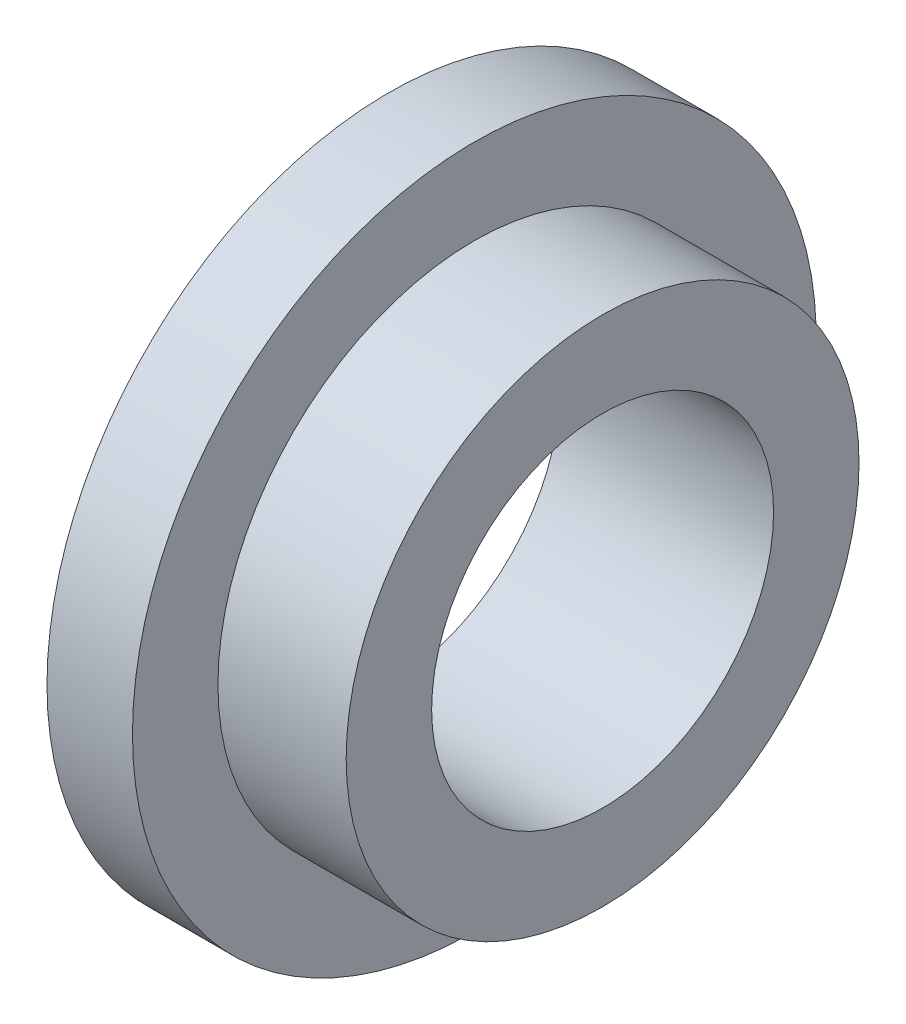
ISO-10303-21;
HEADER;
FILE_DESCRIPTION(('STEP AP214'),'2;1');
FILE_NAME('part.step','',(''),(''),'','','');
FILE_SCHEMA(('AUTOMOTIVE_DESIGN { 1 0 10303 214 1 1 1 1 }'));
ENDSEC;
DATA;
#1=APPLICATION_CONTEXT('core data for automotive mechanical design processes');
#2=APPLICATION_PROTOCOL_DEFINITION('international standard','automotive_design',2000,#1);
#3=PRODUCT_CONTEXT('',#1,'mechanical');
#4=PRODUCT('Part','Part','',(#3));
#5=PRODUCT_RELATED_PRODUCT_CATEGORY('part','',(#4));
#6=PRODUCT_DEFINITION_FORMATION('','',#4);
#7=PRODUCT_DEFINITION_CONTEXT('part definition',#1,'design');
#8=PRODUCT_DEFINITION('design','',#6,#7);
#9=PRODUCT_DEFINITION_SHAPE('','',#8);
#10=(LENGTH_UNIT() NAMED_UNIT(*) SI_UNIT(.MILLI.,.METRE.));
#11=(NAMED_UNIT(*) PLANE_ANGLE_UNIT() SI_UNIT($,.RADIAN.));
#12=(NAMED_UNIT(*) SI_UNIT($,.STERADIAN.) SOLID_ANGLE_UNIT());
#13=UNCERTAINTY_MEASURE_WITH_UNIT(LENGTH_MEASURE(1.E-05),#10,'distance_accuracy_value','');
#14=(GEOMETRIC_REPRESENTATION_CONTEXT(3) GLOBAL_UNCERTAINTY_ASSIGNED_CONTEXT((#13)) GLOBAL_UNIT_ASSIGNED_CONTEXT((#10,
#11,#12)) REPRESENTATION_CONTEXT('',''));
#15=CARTESIAN_POINT('',(0.,0.,0.));
#16=DIRECTION('',(0.,0.,1.));
#17=DIRECTION('',(1.,0.,0.));
#18=AXIS2_PLACEMENT_3D('',#15,#16,#17);
#19=CARTESIAN_POINT('',(0.,0.,0.));
#20=DIRECTION('',(-1.,0.,0.));
#21=DIRECTION('',(0.,0.,1.));
#22=AXIS2_PLACEMENT_3D('',#19,#20,#21);
#23=CYLINDRICAL_SURFACE('',#22,8.);
#24=CARTESIAN_POINT('',(0.,0.,0.));
#25=DIRECTION('',(-1.,0.,0.));
#26=DIRECTION('',(0.,0.,1.));
#27=AXIS2_PLACEMENT_3D('',#24,#25,#26);
#28=CIRCLE('',#27,7.99999999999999);
#29=CARTESIAN_POINT('',(0.,0.,7.99999999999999));
#30=VERTEX_POINT('',#29);
#31=EDGE_CURVE('E10',#30,#30,#28,.T.);
#32=ORIENTED_EDGE('',*,*,#31,.F.);
#33=EDGE_LOOP('',(#32));
#34=FACE_BOUND('',#33,.T.);
#35=CARTESIAN_POINT('',(2.,0.,0.));
#36=DIRECTION('',(-1.,0.,0.));
#37=DIRECTION('',(0.,0.,1.));
#38=AXIS2_PLACEMENT_3D('',#35,#36,#37);
#39=CIRCLE('',#38,8.);
#40=CARTESIAN_POINT('',(2.,0.,8.));
#41=VERTEX_POINT('',#40);
#42=EDGE_CURVE('E52',#41,#41,#39,.T.);
#43=ORIENTED_EDGE('',*,*,#42,.T.);
#44=EDGE_LOOP('',(#43));
#45=FACE_BOUND('',#44,.T.);
#46=ADVANCED_FACE('F30',(#34,#45),#23,.T.);
#47=CARTESIAN_POINT('',(0.,7.99999999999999,0.));
#48=DIRECTION('',(1.,0.,0.));
#49=DIRECTION('',(0.,0.,-1.));
#50=AXIS2_PLACEMENT_3D('',#47,#48,#49);
#51=PLANE('',#50);
#52=CARTESIAN_POINT('',(0.,0.,0.));
#53=DIRECTION('',(-1.,0.,0.));
#54=DIRECTION('',(0.,0.,1.));
#55=AXIS2_PLACEMENT_3D('',#52,#53,#54);
#56=CIRCLE('',#55,4.);
#57=CARTESIAN_POINT('',(0.,0.,4.));
#58=VERTEX_POINT('',#57);
#59=EDGE_CURVE('E36',#58,#58,#56,.T.);
#60=ORIENTED_EDGE('',*,*,#59,.F.);
#61=EDGE_LOOP('',(#60));
#62=FACE_BOUND('',#61,.T.);
#63=ORIENTED_EDGE('',*,*,#31,.T.);
#64=EDGE_LOOP('',(#63));
#65=FACE_BOUND('',#64,.T.);
#66=ADVANCED_FACE('F77',(#62,#65),#51,.F.);
#67=CARTESIAN_POINT('',(0.,0.,0.));
#68=DIRECTION('',(-1.,0.,0.));
#69=DIRECTION('',(0.,0.,1.));
#70=AXIS2_PLACEMENT_3D('',#67,#68,#69);
#71=CYLINDRICAL_SURFACE('',#70,4.);
#72=CARTESIAN_POINT('',(5.,0.,0.));
#73=DIRECTION('',(-1.,0.,0.));
#74=DIRECTION('',(0.,0.,1.));
#75=AXIS2_PLACEMENT_3D('',#72,#73,#74);
#76=CIRCLE('',#75,4.);
#77=CARTESIAN_POINT('',(5.,0.,4.));
#78=VERTEX_POINT('',#77);
#79=EDGE_CURVE('E40',#78,#78,#76,.T.);
#80=ORIENTED_EDGE('',*,*,#79,.F.);
#81=EDGE_LOOP('',(#80));
#82=FACE_BOUND('',#81,.T.);
#83=ORIENTED_EDGE('',*,*,#59,.T.);
#84=EDGE_LOOP('',(#83));
#85=FACE_BOUND('',#84,.T.);
#86=ADVANCED_FACE('F72',(#82,#85),#71,.F.);
#87=CARTESIAN_POINT('',(5.,4.,0.));
#88=DIRECTION('',(-1.,0.,0.));
#89=DIRECTION('',(0.,0.,1.));
#90=AXIS2_PLACEMENT_3D('',#87,#88,#89);
#91=PLANE('',#90);
#92=CARTESIAN_POINT('',(5.,0.,0.));
#93=DIRECTION('',(-1.,0.,0.));
#94=DIRECTION('',(0.,0.,1.));
#95=AXIS2_PLACEMENT_3D('',#92,#93,#94);
#96=CIRCLE('',#95,6.);
#97=CARTESIAN_POINT('',(5.,0.,6.));
#98=VERTEX_POINT('',#97);
#99=EDGE_CURVE('E44',#98,#98,#96,.T.);
#100=ORIENTED_EDGE('',*,*,#99,.F.);
#101=EDGE_LOOP('',(#100));
#102=FACE_BOUND('',#101,.T.);
#103=ORIENTED_EDGE('',*,*,#79,.T.);
#104=EDGE_LOOP('',(#103));
#105=FACE_BOUND('',#104,.T.);
#106=ADVANCED_FACE('F66',(#102,#105),#91,.F.);
#107=CARTESIAN_POINT('',(0.,0.,0.));
#108=DIRECTION('',(-1.,0.,0.));
#109=DIRECTION('',(0.,0.,1.));
#110=AXIS2_PLACEMENT_3D('',#107,#108,#109);
#111=CYLINDRICAL_SURFACE('',#110,6.);
#112=CARTESIAN_POINT('',(2.,0.,0.));
#113=DIRECTION('',(-1.,0.,0.));
#114=DIRECTION('',(0.,0.,1.));
#115=AXIS2_PLACEMENT_3D('',#112,#113,#114);
#116=CIRCLE('',#115,6.);
#117=CARTESIAN_POINT('',(2.,0.,6.));
#118=VERTEX_POINT('',#117);
#119=EDGE_CURVE('E49',#118,#118,#116,.T.);
#120=ORIENTED_EDGE('',*,*,#119,.F.);
#121=EDGE_LOOP('',(#120));
#122=FACE_BOUND('',#121,.T.);
#123=ORIENTED_EDGE('',*,*,#99,.T.);
#124=EDGE_LOOP('',(#123));
#125=FACE_BOUND('',#124,.T.);
#126=ADVANCED_FACE('F60',(#122,#125),#111,.T.);
#127=CARTESIAN_POINT('',(2.,6.,0.));
#128=DIRECTION('',(-1.,0.,0.));
#129=DIRECTION('',(0.,0.,1.));
#130=AXIS2_PLACEMENT_3D('',#127,#128,#129);
#131=PLANE('',#130);
#132=ORIENTED_EDGE('',*,*,#42,.F.);
#133=EDGE_LOOP('',(#132));
#134=FACE_BOUND('',#133,.T.);
#135=ORIENTED_EDGE('',*,*,#119,.T.);
#136=EDGE_LOOP('',(#135));
#137=FACE_BOUND('',#136,.T.);
#138=ADVANCED_FACE('F57',(#134,#137),#131,.F.);
#139=CLOSED_SHELL('',(#46,#66,#86,#106,#126,#138));
#140=MANIFOLD_SOLID_BREP('B2',#139);
#141=ADVANCED_BREP_SHAPE_REPRESENTATION('',(#18,#140),#14);
#142=SHAPE_DEFINITION_REPRESENTATION(#9,#141);
ENDSEC;
END-ISO-10303-21;
